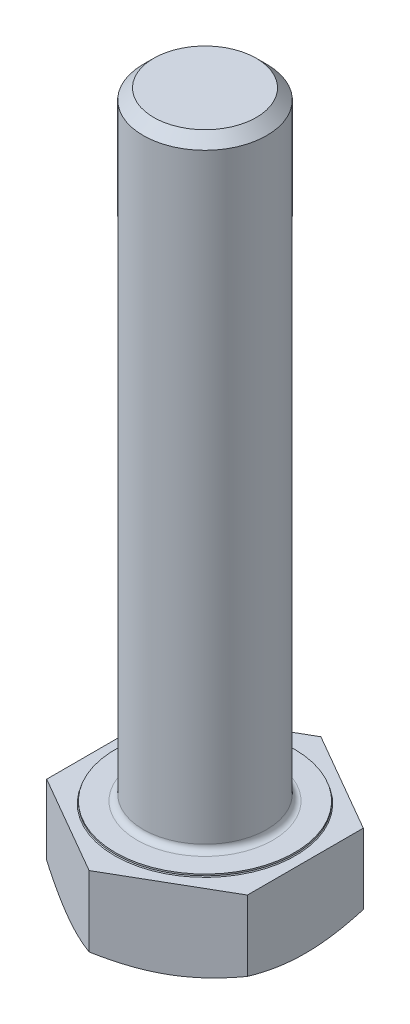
ISO-10303-21;
HEADER;
FILE_DESCRIPTION(('STEP AP214'),'2;1');
FILE_NAME('part.step','',(''),(''),'','','');
FILE_SCHEMA(('AUTOMOTIVE_DESIGN { 1 0 10303 214 1 1 1 1 }'));
ENDSEC;
DATA;
#1=APPLICATION_CONTEXT('core data for automotive mechanical design processes');
#2=APPLICATION_PROTOCOL_DEFINITION('international standard','automotive_design',2000,#1);
#3=PRODUCT_CONTEXT('',#1,'mechanical');
#4=PRODUCT('Part','Part','',(#3));
#5=PRODUCT_RELATED_PRODUCT_CATEGORY('part','',(#4));
#6=PRODUCT_DEFINITION_FORMATION('','',#4);
#7=PRODUCT_DEFINITION_CONTEXT('part definition',#1,'design');
#8=PRODUCT_DEFINITION('design','',#6,#7);
#9=PRODUCT_DEFINITION_SHAPE('','',#8);
#10=(LENGTH_UNIT() NAMED_UNIT(*) SI_UNIT(.MILLI.,.METRE.));
#11=(NAMED_UNIT(*) PLANE_ANGLE_UNIT() SI_UNIT($,.RADIAN.));
#12=(NAMED_UNIT(*) SI_UNIT($,.STERADIAN.) SOLID_ANGLE_UNIT());
#13=UNCERTAINTY_MEASURE_WITH_UNIT(LENGTH_MEASURE(1.E-05),#10,'distance_accuracy_value','');
#14=(GEOMETRIC_REPRESENTATION_CONTEXT(3) GLOBAL_UNCERTAINTY_ASSIGNED_CONTEXT((#13)) GLOBAL_UNIT_ASSIGNED_CONTEXT((#10,
#11,#12)) REPRESENTATION_CONTEXT('',''));
#15=CARTESIAN_POINT('',(0.,0.,0.));
#16=DIRECTION('',(0.,0.,1.));
#17=DIRECTION('',(1.,0.,0.));
#18=AXIS2_PLACEMENT_3D('',#15,#16,#17);
#19=CARTESIAN_POINT('',(0.,-5.3,0.));
#20=DIRECTION('',(0.,-1.,0.));
#21=DIRECTION('',(0.,0.,-1.));
#22=AXIS2_PLACEMENT_3D('',#19,#20,#21);
#23=PLANE('',#22);
#24=CARTESIAN_POINT('',(0.,-5.30000000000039,0.));
#25=DIRECTION('',(0.,1.,0.));
#26=DIRECTION('',(0.,0.,1.));
#27=AXIS2_PLACEMENT_3D('',#24,#25,#26);
#28=CIRCLE('',#27,6.49576787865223);
#29=CARTESIAN_POINT('',(0.,-5.30000000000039,6.49576787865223));
#30=VERTEX_POINT('',#29);
#31=EDGE_CURVE('E84',#30,#30,#28,.T.);
#32=ORIENTED_EDGE('',*,*,#31,.F.);
#33=EDGE_LOOP('',(#32));
#34=FACE_BOUND('',#33,.T.);
#35=ADVANCED_FACE('F14',(#34),#23,.T.);
#36=CARTESIAN_POINT('',(0.,-4.71350195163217,0.));
#37=DIRECTION('',(0.,1.,0.));
#38=DIRECTION('',(0.,0.,1.));
#39=AXIS2_PLACEMENT_3D('',#36,#37,#38);
#40=CONICAL_SURFACE('',#39,7.51161229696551,1.0471975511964);
#41=CARTESIAN_POINT('',(2.64963920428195E-13,-4.71699999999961,7.50555349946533));
#42=CARTESIAN_POINT('',(0.142875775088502,-4.76461607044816,7.42306413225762));
#43=CARTESIAN_POINT('',(0.286284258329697,-4.8100709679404,7.3402672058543));
#44=CARTESIAN_POINT('',(0.574265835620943,-4.89606321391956,7.17400096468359));
#45=CARTESIAN_POINT('',(0.718839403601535,-4.93659844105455,7.09053137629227));
#46=CARTESIAN_POINT('',(1.15487474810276,-5.05002889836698,6.83878625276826));
#47=CARTESIAN_POINT('',(1.44805764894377,-5.11454583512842,6.66951702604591));
#48=CARTESIAN_POINT('',(1.88680049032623,-5.1901977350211,6.41620872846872));
#49=CARTESIAN_POINT('',(2.03104964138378,-5.21174841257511,6.33292644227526));
#50=CARTESIAN_POINT('',(2.32019963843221,-5.24788488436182,6.16598561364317));
#51=CARTESIAN_POINT('',(2.46510042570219,-5.26247129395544,6.08232710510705));
#52=CARTESIAN_POINT('',(2.75515357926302,-5.28430749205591,5.9148648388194));
#53=CARTESIAN_POINT('',(2.90030547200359,-5.29156560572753,5.83106135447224));
#54=CARTESIAN_POINT('',(3.19073522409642,-5.29859737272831,5.66338165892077));
#55=CARTESIAN_POINT('',(3.33601307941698,-5.29837125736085,5.57950545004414));
#56=CARTESIAN_POINT('',(3.73400208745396,-5.28746502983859,5.34972638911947));
#57=CARTESIAN_POINT('',(3.98658288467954,-5.26916555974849,5.20389879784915));
#58=CARTESIAN_POINT('',(4.49006690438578,-5.21114404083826,4.91321216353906));
#59=CARTESIAN_POINT('',(4.74096835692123,-5.17140217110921,4.76835414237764));
#60=CARTESIAN_POINT('',(5.24546517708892,-5.07206148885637,4.4770827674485));
#61=CARTESIAN_POINT('',(5.49899690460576,-5.01204188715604,4.33070615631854));
#62=CARTESIAN_POINT('',(6.00228004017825,-4.8758225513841,4.04013550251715));
#63=CARTESIAN_POINT('',(6.25203789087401,-4.79965480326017,3.89593774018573));
#64=CARTESIAN_POINT('',(6.49999999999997,-4.71699999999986,3.75277674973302));
#65=B_SPLINE_CURVE_WITH_KNOTS('',3,(#41,#42,#43,#44,#45,#46,#47,#48,#49,#50,#51,#52,#53,#54,#55,
#56,#57,#58,#59,#60,#61,#62,#63,#64),.UNSPECIFIED.,.F.,.F.,(4,2,2,2,2,2,2,2,2,2,2,4),(0.,
0.515097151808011,1.03041562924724,2.06319349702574,2.56693469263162,3.07063136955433,
3.5737551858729,4.07686345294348,4.95263085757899,5.82920919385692,6.72522583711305,
7.61948397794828),.UNSPECIFIED.);
#66=CARTESIAN_POINT('',(1.70381806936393E-13,-4.7169999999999,7.50555349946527));
#67=VERTEX_POINT('',#66);
#68=CARTESIAN_POINT('',(6.5,-4.71699999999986,3.75277674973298));
#69=VERTEX_POINT('',#68);
#70=EDGE_CURVE('E93',#67,#69,#65,.T.);
#71=ORIENTED_EDGE('',*,*,#70,.F.);
#72=CARTESIAN_POINT('',(-6.49999999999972,-4.71700000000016,3.75277674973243));
#73=CARTESIAN_POINT('',(-6.35712422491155,-4.76461607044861,3.83526611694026));
#74=CARTESIAN_POINT('',(-6.2137157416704,-4.81007096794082,3.91806304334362));
#75=CARTESIAN_POINT('',(-5.92573416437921,-4.89606321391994,4.08432928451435));
#76=CARTESIAN_POINT('',(-5.78116059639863,-4.93659844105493,4.16779887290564));
#77=CARTESIAN_POINT('',(-5.34512525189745,-5.05002889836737,4.4195439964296));
#78=CARTESIAN_POINT('',(-5.05194235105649,-5.11454583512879,4.58881322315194));
#79=CARTESIAN_POINT('',(-4.61319950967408,-5.19019773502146,4.8421215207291));
#80=CARTESIAN_POINT('',(-4.46895035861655,-5.21174841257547,4.92540380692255));
#81=CARTESIAN_POINT('',(-4.17980036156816,-5.24788488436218,5.09234463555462));
#82=CARTESIAN_POINT('',(-4.0348995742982,-5.2624712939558,5.17600314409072));
#83=CARTESIAN_POINT('',(-3.7448464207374,-5.28430749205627,5.34346541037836));
#84=CARTESIAN_POINT('',(-3.59969452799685,-5.29156560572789,5.4272688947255));
#85=CARTESIAN_POINT('',(-3.30926477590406,-5.29859737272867,5.59494859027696));
#86=CARTESIAN_POINT('',(-3.16398692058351,-5.29837125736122,5.67882479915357));
#87=CARTESIAN_POINT('',(-2.7659979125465,-5.28746502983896,5.90860386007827));
#88=CARTESIAN_POINT('',(-2.51341711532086,-5.26916555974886,6.05443145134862));
#89=CARTESIAN_POINT('',(-2.00993309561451,-5.21114404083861,6.34511808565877));
#90=CARTESIAN_POINT('',(-1.759031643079,-5.17140217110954,6.48997610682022));
#91=CARTESIAN_POINT('',(-1.2545348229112,-5.07206148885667,6.78124748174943));
#92=CARTESIAN_POINT('',(-1.00100309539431,-5.01204188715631,6.92762409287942));
#93=CARTESIAN_POINT('',(-0.497719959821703,-4.87582255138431,7.21819474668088));
#94=CARTESIAN_POINT('',(-0.247962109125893,-4.79965480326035,7.36239250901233));
#95=CARTESIAN_POINT('',(1.23165648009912E-13,-4.71700000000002,7.50555349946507));
#96=B_SPLINE_CURVE_WITH_KNOTS('',3,(#72,#73,#74,#75,#76,#77,#78,#79,#80,#81,#82,#83,#84,#85,#86,
#87,#88,#89,#90,#91,#92,#93,#94,#95),.UNSPECIFIED.,.F.,.F.,(4,2,2,2,2,2,2,2,2,2,2,4),(0.,
0.51509715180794,1.0304156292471,2.06319349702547,2.56693469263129,3.07063136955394,
3.57375518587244,4.07686345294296,4.95263085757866,5.8292091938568,6.72522583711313,
7.61948397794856),.UNSPECIFIED.);
#97=CARTESIAN_POINT('',(-6.49999999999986,-4.71700000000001,3.75277674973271));
#98=VERTEX_POINT('',#97);
#99=EDGE_CURVE('E123',#98,#67,#96,.T.);
#100=ORIENTED_EDGE('',*,*,#99,.F.);
#101=CARTESIAN_POINT('',(-6.50000000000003,-4.71699999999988,-3.75277674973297));
#102=CARTESIAN_POINT('',(-6.50000000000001,-4.76461607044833,-3.58779801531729));
#103=CARTESIAN_POINT('',(-6.5,-4.81007096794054,-3.42220416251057));
#104=CARTESIAN_POINT('',(-6.5,-4.89606321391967,-3.0896716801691));
#105=CARTESIAN_POINT('',(-6.5,-4.93659844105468,-2.92273250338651));
#106=CARTESIAN_POINT('',(-6.5,-5.05002889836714,-2.41924225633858));
#107=CARTESIAN_POINT('',(-6.5,-5.11454583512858,-2.08070380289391));
#108=CARTESIAN_POINT('',(-6.5,-5.19019773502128,-1.57408720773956));
#109=CARTESIAN_POINT('',(-6.5,-5.2117484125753,-1.40752263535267));
#110=CARTESIAN_POINT('',(-6.5,-5.24788488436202,-1.07364097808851));
#111=CARTESIAN_POINT('',(-6.5,-5.26247129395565,-0.906323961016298));
#112=CARTESIAN_POINT('',(-6.5,-5.28430749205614,-0.571399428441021));
#113=CARTESIAN_POINT('',(-6.5,-5.29156560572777,-0.403792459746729));
#114=CARTESIAN_POINT('',(-6.5,-5.29859737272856,-0.0684330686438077));
#115=CARTESIAN_POINT('',(-6.5,-5.29837125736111,0.0993193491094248));
#116=CARTESIAN_POINT('',(-6.5,-5.28746502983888,0.55887747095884));
#117=CARTESIAN_POINT('',(-6.5,-5.26916555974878,0.850532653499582));
#118=CARTESIAN_POINT('',(-6.5,-5.21114404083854,1.43190592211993));
#119=CARTESIAN_POINT('',(-6.5,-5.17140217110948,1.72162196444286));
#120=CARTESIAN_POINT('',(-6.5,-5.07206148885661,2.30416471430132));
#121=CARTESIAN_POINT('',(-6.5,-5.01204188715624,2.59691793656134));
#122=CARTESIAN_POINT('',(-6.5,-4.87582255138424,3.17805924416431));
#123=CARTESIAN_POINT('',(-6.5,-4.79965480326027,3.46645476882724));
#124=CARTESIAN_POINT('',(-6.5,-4.71699999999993,3.75277674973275));
#125=B_SPLINE_CURVE_WITH_KNOTS('',3,(#101,#102,#103,#104,#105,#106,#107,#108,#109,#110,#111,
#112,#113,#114,#115,#116,#117,#118,#119,#120,#121,#122,#123,#124),.UNSPECIFIED.,.F.,.F.,(4,2,2,
2,2,2,2,2,2,2,2,4),(0.,0.515097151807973,1.03041562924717,2.0631934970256,2.56693469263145,
3.07063136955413,3.57375518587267,4.07686345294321,4.95263085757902,5.82920919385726,
6.72522583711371,7.61948397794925),.UNSPECIFIED.);
#126=CARTESIAN_POINT('',(-6.5,-4.71699999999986,-3.75277674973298));
#127=VERTEX_POINT('',#126);
#128=EDGE_CURVE('E142',#127,#98,#125,.T.);
#129=ORIENTED_EDGE('',*,*,#128,.F.);
#130=CARTESIAN_POINT('',(-3.32799820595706E-13,-4.71699999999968,-7.50555349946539));
#131=CARTESIAN_POINT('',(-0.142875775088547,-4.76461607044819,-7.42306413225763));
#132=CARTESIAN_POINT('',(-0.286284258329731,-4.81007096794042,-7.34026720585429));
#133=CARTESIAN_POINT('',(-0.574265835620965,-4.89606321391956,-7.17400096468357));
#134=CARTESIAN_POINT('',(-0.718839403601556,-4.93659844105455,-7.09053137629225));
#135=CARTESIAN_POINT('',(-1.15487474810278,-5.05002889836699,-6.83878625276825));
#136=CARTESIAN_POINT('',(-1.44805764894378,-5.11454583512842,-6.66951702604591));
#137=CARTESIAN_POINT('',(-1.88680049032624,-5.1901977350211,-6.41620872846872));
#138=CARTESIAN_POINT('',(-2.03104964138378,-5.21174841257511,-6.33292644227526));
#139=CARTESIAN_POINT('',(-2.3201996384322,-5.24788488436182,-6.16598561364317));
#140=CARTESIAN_POINT('',(-2.46510042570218,-5.26247129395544,-6.08232710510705));
#141=CARTESIAN_POINT('',(-2.75515357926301,-5.28430749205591,-5.9148648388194));
#142=CARTESIAN_POINT('',(-2.90030547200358,-5.29156560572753,-5.83106135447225));
#143=CARTESIAN_POINT('',(-3.1907352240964,-5.29859737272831,-5.66338165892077));
#144=CARTESIAN_POINT('',(-3.33601307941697,-5.29837125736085,-5.57950545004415));
#145=CARTESIAN_POINT('',(-3.73400208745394,-5.28746502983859,-5.34972638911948));
#146=CARTESIAN_POINT('',(-3.98658288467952,-5.26916555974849,-5.20389879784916));
#147=CARTESIAN_POINT('',(-4.49006690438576,-5.21114404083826,-4.91321216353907));
#148=CARTESIAN_POINT('',(-4.74096835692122,-5.17140217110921,-4.76835414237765));
#149=CARTESIAN_POINT('',(-5.24546517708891,-5.07206148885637,-4.47708276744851));
#150=CARTESIAN_POINT('',(-5.49899690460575,-5.01204188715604,-4.33070615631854));
#151=CARTESIAN_POINT('',(-6.00228004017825,-4.8758225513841,-4.04013550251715));
#152=CARTESIAN_POINT('',(-6.25203789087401,-4.79965480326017,-3.89593774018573));
#153=CARTESIAN_POINT('',(-6.49999999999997,-4.71699999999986,-3.75277674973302));
#154=B_SPLINE_CURVE_WITH_KNOTS('',3,(#130,#131,#132,#133,#134,#135,#136,#137,#138,#139,#140,
#141,#142,#143,#144,#145,#146,#147,#148,#149,#150,#151,#152,#153),.UNSPECIFIED.,.F.,.F.,(4,2,2,
2,2,2,2,2,2,2,2,4),(0.,0.515097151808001,1.03041562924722,2.0631934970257,2.56693469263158,
3.07063136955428,3.57375518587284,4.07686345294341,4.95263085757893,5.82920919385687,
6.725225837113,7.61948397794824),.UNSPECIFIED.);
#155=CARTESIAN_POINT('',(0.,-4.71699999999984,-7.50555349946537));
#156=VERTEX_POINT('',#155);
#157=EDGE_CURVE('E81',#156,#127,#154,.T.);
#158=ORIENTED_EDGE('',*,*,#157,.F.);
#159=CARTESIAN_POINT('',(6.49999999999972,-4.71700000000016,-3.75277674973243));
#160=CARTESIAN_POINT('',(6.35712422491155,-4.76461607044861,-3.83526611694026));
#161=CARTESIAN_POINT('',(6.2137157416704,-4.81007096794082,-3.91806304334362));
#162=CARTESIAN_POINT('',(5.92573416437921,-4.89606321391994,-4.08432928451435));
#163=CARTESIAN_POINT('',(5.78116059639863,-4.93659844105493,-4.16779887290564));
#164=CARTESIAN_POINT('',(5.34512525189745,-5.05002889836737,-4.4195439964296));
#165=CARTESIAN_POINT('',(5.05194235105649,-5.11454583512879,-4.58881322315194));
#166=CARTESIAN_POINT('',(4.61319950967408,-5.19019773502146,-4.8421215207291));
#167=CARTESIAN_POINT('',(4.46895035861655,-5.21174841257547,-4.92540380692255));
#168=CARTESIAN_POINT('',(4.17980036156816,-5.24788488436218,-5.09234463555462));
#169=CARTESIAN_POINT('',(4.0348995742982,-5.2624712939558,-5.17600314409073));
#170=CARTESIAN_POINT('',(3.7448464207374,-5.28430749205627,-5.34346541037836));
#171=CARTESIAN_POINT('',(3.59969452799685,-5.29156560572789,-5.4272688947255));
#172=CARTESIAN_POINT('',(3.30926477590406,-5.29859737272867,-5.59494859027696));
#173=CARTESIAN_POINT('',(3.16398692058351,-5.29837125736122,-5.67882479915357));
#174=CARTESIAN_POINT('',(2.76599791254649,-5.28746502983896,-5.90860386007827));
#175=CARTESIAN_POINT('',(2.51341711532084,-5.26916555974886,-6.05443145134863));
#176=CARTESIAN_POINT('',(2.00993309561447,-5.2111440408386,-6.34511808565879));
#177=CARTESIAN_POINT('',(1.75903164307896,-5.17140217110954,-6.48997610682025));
#178=CARTESIAN_POINT('',(1.25453482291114,-5.07206148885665,-6.78124748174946));
#179=CARTESIAN_POINT('',(1.00100309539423,-5.01204188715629,-6.92762409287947));
#180=CARTESIAN_POINT('',(0.497719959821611,-4.87582255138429,-7.21819474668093));
#181=CARTESIAN_POINT('',(0.247962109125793,-4.79965480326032,-7.36239250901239));
#182=CARTESIAN_POINT('',(-2.31932876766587E-13,-4.71699999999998,-7.50555349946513));
#183=B_SPLINE_CURVE_WITH_KNOTS('',3,(#159,#160,#161,#162,#163,#164,#165,#166,#167,#168,#169,
#170,#171,#172,#173,#174,#175,#176,#177,#178,#179,#180,#181,#182),.UNSPECIFIED.,.F.,.F.,(4,2,2,
2,2,2,2,2,2,2,2,4),(0.,0.51509715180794,1.0304156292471,2.06319349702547,2.56693469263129,
3.07063136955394,3.57375518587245,4.07686345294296,4.9526308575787,5.82920919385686,
6.72522583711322,7.61948397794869),.UNSPECIFIED.);
#184=CARTESIAN_POINT('',(6.49999999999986,-4.71700000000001,-3.75277674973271));
#185=VERTEX_POINT('',#184);
#186=EDGE_CURVE('E73',#185,#156,#183,.T.);
#187=ORIENTED_EDGE('',*,*,#186,.F.);
#188=CARTESIAN_POINT('',(6.50000000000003,-4.71699999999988,3.75277674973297));
#189=CARTESIAN_POINT('',(6.50000000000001,-4.76461607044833,3.58779801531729));
#190=CARTESIAN_POINT('',(6.5,-4.81007096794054,3.42220416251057));
#191=CARTESIAN_POINT('',(6.5,-4.89606321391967,3.0896716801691));
#192=CARTESIAN_POINT('',(6.5,-4.93659844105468,2.92273250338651));
#193=CARTESIAN_POINT('',(6.5,-5.05002889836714,2.41924225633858));
#194=CARTESIAN_POINT('',(6.5,-5.11454583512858,2.08070380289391));
#195=CARTESIAN_POINT('',(6.5,-5.19019773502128,1.57408720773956));
#196=CARTESIAN_POINT('',(6.5,-5.2117484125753,1.40752263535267));
#197=CARTESIAN_POINT('',(6.5,-5.24788488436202,1.07364097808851));
#198=CARTESIAN_POINT('',(6.5,-5.26247129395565,0.906323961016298));
#199=CARTESIAN_POINT('',(6.5,-5.28430749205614,0.571399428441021));
#200=CARTESIAN_POINT('',(6.5,-5.29156560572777,0.403792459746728));
#201=CARTESIAN_POINT('',(6.5,-5.29859737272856,0.0684330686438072));
#202=CARTESIAN_POINT('',(6.5,-5.29837125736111,-0.0993193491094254));
#203=CARTESIAN_POINT('',(6.5,-5.28746502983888,-0.558877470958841));
#204=CARTESIAN_POINT('',(6.5,-5.26916555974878,-0.850532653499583));
#205=CARTESIAN_POINT('',(6.5,-5.21114404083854,-1.43190592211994));
#206=CARTESIAN_POINT('',(6.5,-5.17140217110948,-1.72162196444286));
#207=CARTESIAN_POINT('',(6.5,-5.07206148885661,-2.30416471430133));
#208=CARTESIAN_POINT('',(6.5,-5.01204188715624,-2.59691793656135));
#209=CARTESIAN_POINT('',(6.5,-4.87582255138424,-3.17805924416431));
#210=CARTESIAN_POINT('',(6.5,-4.79965480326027,-3.46645476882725));
#211=CARTESIAN_POINT('',(6.5,-4.71699999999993,-3.75277674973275));
#212=B_SPLINE_CURVE_WITH_KNOTS('',3,(#188,#189,#190,#191,#192,#193,#194,#195,#196,#197,#198,
#199,#200,#201,#202,#203,#204,#205,#206,#207,#208,#209,#210,#211),.UNSPECIFIED.,.F.,.F.,(4,2,2,
2,2,2,2,2,2,2,2,4),(0.,0.515097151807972,1.03041562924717,2.0631934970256,2.56693469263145,
3.07063136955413,3.57375518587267,4.07686345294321,4.95263085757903,5.82920919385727,
6.72522583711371,7.61948397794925),.UNSPECIFIED.);
#213=EDGE_CURVE('E78',#69,#185,#212,.T.);
#214=ORIENTED_EDGE('',*,*,#213,.F.);
#215=EDGE_LOOP('',(#71,#100,#129,#158,#187,#214));
#216=FACE_BOUND('',#215,.T.);
#217=ORIENTED_EDGE('',*,*,#31,.T.);
#218=EDGE_LOOP('',(#217));
#219=FACE_BOUND('',#218,.T.);
#220=ADVANCED_FACE('F75',(#216,#219),#40,.T.);
#221=CARTESIAN_POINT('',(0.,0.,-7.505553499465));
#222=DIRECTION('',(0.500000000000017,0.,-0.866025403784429));
#223=DIRECTION('',(-0.866025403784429,0.,-0.500000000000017));
#224=AXIS2_PLACEMENT_3D('',#221,#222,#223);
#225=PLANE('',#224);
#226=DIRECTION('',(0.,1.,0.));
#227=VECTOR('',#226,1.);
#228=CARTESIAN_POINT('',(-3.17454396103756E-13,0.,-7.50555349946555));
#229=LINE('',#228,#227);
#230=CARTESIAN_POINT('',(-1.58510357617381E-13,-0.15,-7.50555349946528));
#231=VERTEX_POINT('',#230);
#232=EDGE_CURVE('E139',#231,#156,#229,.F.);
#233=ORIENTED_EDGE('',*,*,#232,.F.);
#234=DIRECTION('',(0.866025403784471,0.,0.499999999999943));
#235=VECTOR('',#234,1.);
#236=CARTESIAN_POINT('',(0.,-0.15,-7.505553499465));
#237=LINE('',#236,#235);
#238=CARTESIAN_POINT('',(6.5,-0.15,-3.75277674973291));
#239=VERTEX_POINT('',#238);
#240=EDGE_CURVE('E90',#231,#239,#237,.T.);
#241=ORIENTED_EDGE('',*,*,#240,.T.);
#242=DIRECTION('',(0.,1.,0.));
#243=VECTOR('',#242,1.);
#244=CARTESIAN_POINT('',(6.5,0.,-3.752776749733));
#245=LINE('',#244,#243);
#246=EDGE_CURVE('E87',#185,#239,#245,.T.);
#247=ORIENTED_EDGE('',*,*,#246,.F.);
#248=ORIENTED_EDGE('',*,*,#186,.T.);
#249=EDGE_LOOP('',(#233,#241,#247,#248));
#250=FACE_BOUND('',#249,.T.);
#251=ADVANCED_FACE('F88',(#250),#225,.T.);
#252=CARTESIAN_POINT('',(6.5,0.,-3.752776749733));
#253=DIRECTION('',(1.,0.,0.));
#254=DIRECTION('',(0.,0.,-1.));
#255=AXIS2_PLACEMENT_3D('',#252,#253,#254);
#256=PLANE('',#255);
#257=ORIENTED_EDGE('',*,*,#246,.T.);
#258=DIRECTION('',(0.,0.,-1.));
#259=VECTOR('',#258,1.);
#260=CARTESIAN_POINT('',(6.5,-0.15,0.));
#261=LINE('',#260,#259);
#262=CARTESIAN_POINT('',(6.5,-0.15,3.752776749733));
#263=VERTEX_POINT('',#262);
#264=EDGE_CURVE('E229',#239,#263,#261,.F.);
#265=ORIENTED_EDGE('',*,*,#264,.T.);
#266=DIRECTION('',(0.,1.,0.));
#267=VECTOR('',#266,1.);
#268=CARTESIAN_POINT('',(6.5,0.,3.752776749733));
#269=LINE('',#268,#267);
#270=EDGE_CURVE('E97',#69,#263,#269,.T.);
#271=ORIENTED_EDGE('',*,*,#270,.F.);
#272=ORIENTED_EDGE('',*,*,#213,.T.);
#273=EDGE_LOOP('',(#257,#265,#271,#272));
#274=FACE_BOUND('',#273,.T.);
#275=ADVANCED_FACE('F95',(#274),#256,.T.);
#276=CARTESIAN_POINT('',(6.5,0.,3.752776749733));
#277=DIRECTION('',(0.500000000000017,0.,0.866025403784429));
#278=DIRECTION('',(0.866025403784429,0.,-0.500000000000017));
#279=AXIS2_PLACEMENT_3D('',#276,#277,#278);
#280=PLANE('',#279);
#281=ORIENTED_EDGE('',*,*,#270,.T.);
#282=DIRECTION('',(-0.866025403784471,0.,0.499999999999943));
#283=VECTOR('',#282,1.);
#284=CARTESIAN_POINT('',(6.5,-0.15,3.752776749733));
#285=LINE('',#284,#283);
#286=CARTESIAN_POINT('',(1.19016087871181E-13,-0.15,7.50555349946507));
#287=VERTEX_POINT('',#286);
#288=EDGE_CURVE('E231',#263,#287,#285,.T.);
#289=ORIENTED_EDGE('',*,*,#288,.T.);
#290=DIRECTION('',(0.,1.,0.));
#291=VECTOR('',#290,1.);
#292=CARTESIAN_POINT('',(0.,0.,7.505553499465));
#293=LINE('',#292,#291);
#294=EDGE_CURVE('E202',#67,#287,#293,.T.);
#295=ORIENTED_EDGE('',*,*,#294,.F.);
#296=ORIENTED_EDGE('',*,*,#70,.T.);
#297=EDGE_LOOP('',(#281,#289,#295,#296));
#298=FACE_BOUND('',#297,.T.);
#299=ADVANCED_FACE('F213',(#298),#280,.T.);
#300=CARTESIAN_POINT('',(0.,0.,7.505553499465));
#301=DIRECTION('',(-0.500000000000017,0.,0.866025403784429));
#302=DIRECTION('',(0.866025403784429,0.,0.500000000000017));
#303=AXIS2_PLACEMENT_3D('',#300,#301,#302);
#304=PLANE('',#303);
#305=ORIENTED_EDGE('',*,*,#294,.T.);
#306=DIRECTION('',(-0.866025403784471,0.,-0.499999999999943));
#307=VECTOR('',#306,1.);
#308=CARTESIAN_POINT('',(0.,-0.15,7.505553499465));
#309=LINE('',#308,#307);
#310=CARTESIAN_POINT('',(-6.5,-0.15,3.75277674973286));
#311=VERTEX_POINT('',#310);
#312=EDGE_CURVE('E220',#287,#311,#309,.T.);
#313=ORIENTED_EDGE('',*,*,#312,.T.);
#314=DIRECTION('',(0.,1.,0.));
#315=VECTOR('',#314,1.);
#316=CARTESIAN_POINT('',(-6.5,0.,3.752776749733));
#317=LINE('',#316,#315);
#318=EDGE_CURVE('E191',#98,#311,#317,.T.);
#319=ORIENTED_EDGE('',*,*,#318,.F.);
#320=ORIENTED_EDGE('',*,*,#99,.T.);
#321=EDGE_LOOP('',(#305,#313,#319,#320));
#322=FACE_BOUND('',#321,.T.);
#323=ADVANCED_FACE('F218',(#322),#304,.T.);
#324=CARTESIAN_POINT('',(-6.5,0.,3.752776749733));
#325=DIRECTION('',(-1.,0.,0.));
#326=DIRECTION('',(0.,0.,1.));
#327=AXIS2_PLACEMENT_3D('',#324,#325,#326);
#328=PLANE('',#327);
#329=ORIENTED_EDGE('',*,*,#318,.T.);
#330=DIRECTION('',(0.,0.,-1.));
#331=VECTOR('',#330,1.);
#332=CARTESIAN_POINT('',(-6.5,-0.15,0.));
#333=LINE('',#332,#331);
#334=CARTESIAN_POINT('',(-6.5,-0.15,-3.752776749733));
#335=VERTEX_POINT('',#334);
#336=EDGE_CURVE('E223',#311,#335,#333,.T.);
#337=ORIENTED_EDGE('',*,*,#336,.T.);
#338=DIRECTION('',(0.,1.,0.));
#339=VECTOR('',#338,1.);
#340=CARTESIAN_POINT('',(-6.5,0.,-3.752776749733));
#341=LINE('',#340,#339);
#342=EDGE_CURVE('E138',#127,#335,#341,.T.);
#343=ORIENTED_EDGE('',*,*,#342,.F.);
#344=ORIENTED_EDGE('',*,*,#128,.T.);
#345=EDGE_LOOP('',(#329,#337,#343,#344));
#346=FACE_BOUND('',#345,.T.);
#347=ADVANCED_FACE('F152',(#346),#328,.T.);
#348=CARTESIAN_POINT('',(-6.5,0.,-3.752776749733));
#349=DIRECTION('',(-0.500000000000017,0.,-0.866025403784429));
#350=DIRECTION('',(-0.866025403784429,0.,0.500000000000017));
#351=AXIS2_PLACEMENT_3D('',#348,#349,#350);
#352=PLANE('',#351);
#353=ORIENTED_EDGE('',*,*,#342,.T.);
#354=DIRECTION('',(0.866025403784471,0.,-0.499999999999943));
#355=VECTOR('',#354,1.);
#356=CARTESIAN_POINT('',(-6.5,-0.15,-3.752776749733));
#357=LINE('',#356,#355);
#358=EDGE_CURVE('E226',#335,#231,#357,.T.);
#359=ORIENTED_EDGE('',*,*,#358,.T.);
#360=ORIENTED_EDGE('',*,*,#232,.T.);
#361=ORIENTED_EDGE('',*,*,#157,.T.);
#362=EDGE_LOOP('',(#353,#359,#360,#361));
#363=FACE_BOUND('',#362,.T.);
#364=ADVANCED_FACE('F147',(#363),#352,.T.);
#365=CARTESIAN_POINT('',(0.,-0.15,0.));
#366=DIRECTION('',(0.,-1.,0.));
#367=DIRECTION('',(0.,0.,-1.));
#368=AXIS2_PLACEMENT_3D('',#365,#366,#367);
#369=PLANE('',#368);
#370=CARTESIAN_POINT('',(0.,-0.150000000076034,0.));
#371=DIRECTION('',(0.,-1.,0.));
#372=DIRECTION('',(0.,0.,-1.));
#373=AXIS2_PLACEMENT_3D('',#370,#371,#372);
#374=CIRCLE('',#373,5.85000000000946);
#375=CARTESIAN_POINT('',(0.,-0.150000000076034,-5.85000000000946));
#376=VERTEX_POINT('',#375);
#377=EDGE_CURVE('E140',#376,#376,#374,.F.);
#378=ORIENTED_EDGE('',*,*,#377,.F.);
#379=EDGE_LOOP('',(#378));
#380=FACE_BOUND('',#379,.T.);
#381=ORIENTED_EDGE('',*,*,#336,.F.);
#382=ORIENTED_EDGE('',*,*,#312,.F.);
#383=ORIENTED_EDGE('',*,*,#288,.F.);
#384=ORIENTED_EDGE('',*,*,#264,.F.);
#385=ORIENTED_EDGE('',*,*,#240,.F.);
#386=ORIENTED_EDGE('',*,*,#358,.F.);
#387=EDGE_LOOP('',(#381,#382,#383,#384,#385,#386));
#388=FACE_BOUND('',#387,.T.);
#389=ADVANCED_FACE('F151',(#380,#388),#369,.F.);
#390=CARTESIAN_POINT('',(0.,-0.15000000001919,0.));
#391=DIRECTION('',(0.,-1.,0.));
#392=DIRECTION('',(0.,0.,-1.));
#393=AXIS2_PLACEMENT_3D('',#390,#391,#392);
#394=CONICAL_SURFACE('',#393,5.84999999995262,0.785398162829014);
#395=CARTESIAN_POINT('',(0.,-0.1,0.));
#396=DIRECTION('',(0.,-1.,0.));
#397=DIRECTION('',(0.,0.,1.));
#398=AXIS2_PLACEMENT_3D('',#395,#396,#397);
#399=CIRCLE('',#398,5.8);
#400=CARTESIAN_POINT('',(0.,-0.1,5.8));
#401=VERTEX_POINT('',#400);
#402=EDGE_CURVE('E247',#401,#401,#399,.F.);
#403=ORIENTED_EDGE('',*,*,#402,.F.);
#404=EDGE_LOOP('',(#403));
#405=FACE_BOUND('',#404,.T.);
#406=ORIENTED_EDGE('',*,*,#377,.T.);
#407=EDGE_LOOP('',(#406));
#408=FACE_BOUND('',#407,.T.);
#409=ADVANCED_FACE('F157',(#405,#408),#394,.T.);
#410=CARTESIAN_POINT('',(0.,0.,0.));
#411=DIRECTION('',(0.,-1.,0.));
#412=DIRECTION('',(0.,0.,-1.));
#413=AXIS2_PLACEMENT_3D('',#410,#411,#412);
#414=CYLINDRICAL_SURFACE('',#413,5.8);
#415=ORIENTED_EDGE('',*,*,#402,.T.);
#416=EDGE_LOOP('',(#415));
#417=FACE_BOUND('',#416,.T.);
#418=CARTESIAN_POINT('',(0.,0.,0.));
#419=DIRECTION('',(0.,-1.,0.));
#420=DIRECTION('',(0.,0.,-1.));
#421=AXIS2_PLACEMENT_3D('',#418,#419,#420);
#422=CIRCLE('',#421,5.8);
#423=CARTESIAN_POINT('',(0.,0.,-5.8));
#424=VERTEX_POINT('',#423);
#425=EDGE_CURVE('E245',#424,#424,#422,.T.);
#426=ORIENTED_EDGE('',*,*,#425,.T.);
#427=EDGE_LOOP('',(#426));
#428=FACE_BOUND('',#427,.T.);
#429=ADVANCED_FACE('F161',(#417,#428),#414,.T.);
#430=CARTESIAN_POINT('',(0.,0.,0.));
#431=DIRECTION('',(0.,-1.,0.));
#432=DIRECTION('',(0.,0.,-1.));
#433=AXIS2_PLACEMENT_3D('',#430,#431,#432);
#434=PLANE('',#433);
#435=CARTESIAN_POINT('',(0.,0.,0.));
#436=DIRECTION('',(0.,1.,0.));
#437=DIRECTION('',(-1.,0.,0.));
#438=AXIS2_PLACEMENT_3D('',#435,#436,#437);
#439=CIRCLE('',#438,4.4);
#440=CARTESIAN_POINT('',(4.4,0.,0.));
#441=VERTEX_POINT('',#440);
#442=CARTESIAN_POINT('',(-4.4,0.,0.));
#443=VERTEX_POINT('',#442);
#444=EDGE_CURVE('E187',#441,#443,#439,.F.);
#445=ORIENTED_EDGE('',*,*,#444,.T.);
#446=CARTESIAN_POINT('',(0.,0.,0.));
#447=DIRECTION('',(0.,1.,0.));
#448=DIRECTION('',(1.,0.,0.));
#449=AXIS2_PLACEMENT_3D('',#446,#447,#448);
#450=CIRCLE('',#449,4.4);
#451=EDGE_CURVE('E34',#443,#441,#450,.F.);
#452=ORIENTED_EDGE('',*,*,#451,.T.);
#453=EDGE_LOOP('',(#445,#452));
#454=FACE_BOUND('',#453,.T.);
#455=ORIENTED_EDGE('',*,*,#425,.F.);
#456=EDGE_LOOP('',(#455));
#457=FACE_BOUND('',#456,.T.);
#458=ADVANCED_FACE('F165',(#454,#457),#434,.F.);
#459=CARTESIAN_POINT('',(0.,0.4,0.));
#460=DIRECTION('',(0.,1.,0.));
#461=DIRECTION('',(1.,0.,0.));
#462=AXIS2_PLACEMENT_3D('',#459,#460,#461);
#463=TOROIDAL_SURFACE('',#462,4.4,0.4);
#464=CARTESIAN_POINT('',(0.,0.4,0.));
#465=DIRECTION('',(0.,1.,0.));
#466=DIRECTION('',(1.,0.,0.));
#467=AXIS2_PLACEMENT_3D('',#464,#465,#466);
#468=CIRCLE('',#467,4.);
#469=CARTESIAN_POINT('',(4.,0.4,0.));
#470=VERTEX_POINT('',#469);
#471=EDGE_CURVE('E268',#470,#470,#468,.T.);
#472=ORIENTED_EDGE('',*,*,#471,.F.);
#473=EDGE_LOOP('',(#472));
#474=FACE_BOUND('',#473,.T.);
#475=ORIENTED_EDGE('',*,*,#444,.F.);
#476=ORIENTED_EDGE('',*,*,#451,.F.);
#477=EDGE_LOOP('',(#475,#476));
#478=FACE_BOUND('',#477,.T.);
#479=ADVANCED_FACE('F169',(#474,#478),#463,.F.);
#480=CARTESIAN_POINT('',(0.,0.4,0.));
#481=DIRECTION('',(0.,1.,0.));
#482=DIRECTION('',(0.,0.,1.));
#483=AXIS2_PLACEMENT_3D('',#480,#481,#482);
#484=CYLINDRICAL_SURFACE('',#483,4.);
#485=CARTESIAN_POINT('',(0.,39.3234374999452,0.));
#486=DIRECTION('',(0.,-1.,0.));
#487=DIRECTION('',(-1.,0.,0.));
#488=AXIS2_PLACEMENT_3D('',#485,#486,#487);
#489=CIRCLE('',#488,4.0000000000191);
#490=CARTESIAN_POINT('',(-4.0000000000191,39.3234374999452,0.));
#491=VERTEX_POINT('',#490);
#492=EDGE_CURVE('E26',#491,#491,#489,.F.);
#493=ORIENTED_EDGE('',*,*,#492,.F.);
#494=EDGE_LOOP('',(#493));
#495=FACE_BOUND('',#494,.T.);
#496=ORIENTED_EDGE('',*,*,#471,.T.);
#497=EDGE_LOOP('',(#496));
#498=FACE_BOUND('',#497,.T.);
#499=ADVANCED_FACE('F277',(#495,#498),#484,.T.);
#500=CARTESIAN_POINT('',(0.,39.3234374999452,0.));
#501=DIRECTION('',(0.,-1.,0.));
#502=DIRECTION('',(0.,0.,-1.));
#503=AXIS2_PLACEMENT_3D('',#500,#501,#502);
#504=CONICAL_SURFACE('',#503,4.0000000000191,0.785398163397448);
#505=CARTESIAN_POINT('',(0.,40.0000000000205,0.));
#506=DIRECTION('',(0.,-1.,0.));
#507=DIRECTION('',(0.,0.,-1.));
#508=AXIS2_PLACEMENT_3D('',#505,#506,#507);
#509=CIRCLE('',#508,3.32343749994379);
#510=CARTESIAN_POINT('',(0.,40.0000000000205,-3.32343749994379));
#511=VERTEX_POINT('',#510);
#512=EDGE_CURVE('E9',#511,#511,#509,.F.);
#513=ORIENTED_EDGE('',*,*,#512,.F.);
#514=EDGE_LOOP('',(#513));
#515=FACE_BOUND('',#514,.T.);
#516=ORIENTED_EDGE('',*,*,#492,.T.);
#517=EDGE_LOOP('',(#516));
#518=FACE_BOUND('',#517,.T.);
#519=ADVANCED_FACE('F275',(#515,#518),#504,.T.);
#520=CARTESIAN_POINT('',(0.,40.,0.));
#521=DIRECTION('',(0.,1.,0.));
#522=DIRECTION('',(0.,0.,1.));
#523=AXIS2_PLACEMENT_3D('',#520,#521,#522);
#524=PLANE('',#523);
#525=ORIENTED_EDGE('',*,*,#512,.T.);
#526=EDGE_LOOP('',(#525));
#527=FACE_BOUND('',#526,.T.);
#528=ADVANCED_FACE('F16',(#527),#524,.T.);
#529=CLOSED_SHELL('',(#35,#220,#251,#275,#299,#323,#347,#364,#389,#409,#429,#458,#479,#499,#519,#528));
#530=MANIFOLD_SOLID_BREP('B1',#529);
#531=ADVANCED_BREP_SHAPE_REPRESENTATION('',(#18,#530),#14);
#532=SHAPE_DEFINITION_REPRESENTATION(#9,#531);
ENDSEC;
END-ISO-10303-21;
